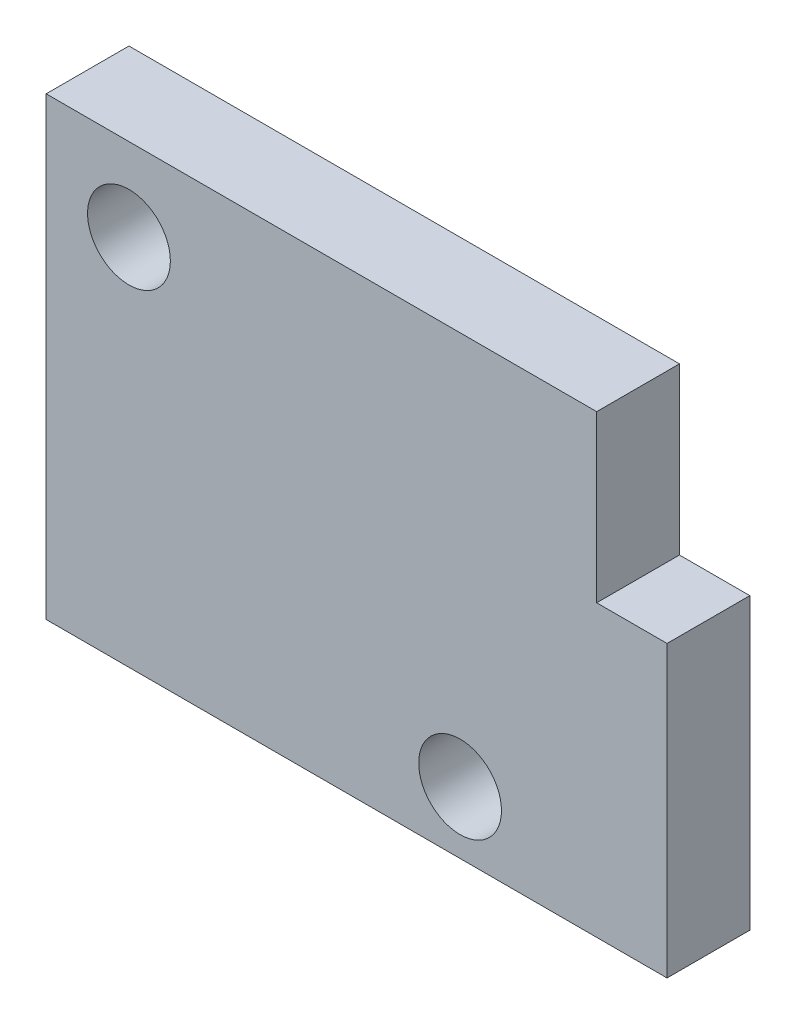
ISO-10303-21;
HEADER;
FILE_DESCRIPTION(('STEP AP214'),'2;1');
FILE_NAME('part.step','',(''),(''),'','','');
FILE_SCHEMA(('AUTOMOTIVE_DESIGN { 1 0 10303 214 1 1 1 1 }'));
ENDSEC;
DATA;
#1=APPLICATION_CONTEXT('core data for automotive mechanical design processes');
#2=APPLICATION_PROTOCOL_DEFINITION('international standard','automotive_design',2000,#1);
#3=PRODUCT_CONTEXT('',#1,'mechanical');
#4=PRODUCT('Part','Part','',(#3));
#5=PRODUCT_RELATED_PRODUCT_CATEGORY('part','',(#4));
#6=PRODUCT_DEFINITION_FORMATION('','',#4);
#7=PRODUCT_DEFINITION_CONTEXT('part definition',#1,'design');
#8=PRODUCT_DEFINITION('design','',#6,#7);
#9=PRODUCT_DEFINITION_SHAPE('','',#8);
#10=(LENGTH_UNIT() NAMED_UNIT(*) SI_UNIT(.MILLI.,.METRE.));
#11=(NAMED_UNIT(*) PLANE_ANGLE_UNIT() SI_UNIT($,.RADIAN.));
#12=(NAMED_UNIT(*) SI_UNIT($,.STERADIAN.) SOLID_ANGLE_UNIT());
#13=UNCERTAINTY_MEASURE_WITH_UNIT(LENGTH_MEASURE(1.E-05),#10,'distance_accuracy_value','');
#14=(GEOMETRIC_REPRESENTATION_CONTEXT(3) GLOBAL_UNCERTAINTY_ASSIGNED_CONTEXT((#13)) GLOBAL_UNIT_ASSIGNED_CONTEXT((#10,
#11,#12)) REPRESENTATION_CONTEXT('',''));
#15=CARTESIAN_POINT('',(0.,0.,0.));
#16=DIRECTION('',(0.,0.,1.));
#17=DIRECTION('',(1.,0.,0.));
#18=AXIS2_PLACEMENT_3D('',#15,#16,#17);
#19=CARTESIAN_POINT('',(0.,0.,1.));
#20=DIRECTION('',(0.,0.,-1.));
#21=DIRECTION('',(-1.,0.,0.));
#22=AXIS2_PLACEMENT_3D('',#19,#20,#21);
#23=PLANE('',#22);
#24=CARTESIAN_POINT('',(-2.49832946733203,1.56544160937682,1.));
#25=DIRECTION('',(0.,0.,1.));
#26=DIRECTION('',(1.,0.,0.));
#27=AXIS2_PLACEMENT_3D('',#24,#25,#26);
#28=CIRCLE('',#27,0.5);
#29=CARTESIAN_POINT('',(-1.99832946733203,1.56544160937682,1.));
#30=VERTEX_POINT('',#29);
#31=EDGE_CURVE('E126',#30,#30,#28,.T.);
#32=ORIENTED_EDGE('',*,*,#31,.F.);
#33=EDGE_LOOP('',(#32));
#34=FACE_BOUND('',#33,.T.);
#35=DIRECTION('',(0.,-1.,0.));
#36=VECTOR('',#35,1.);
#37=CARTESIAN_POINT('',(-3.49832946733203,2.56544160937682,1.));
#38=LINE('',#37,#36);
#39=CARTESIAN_POINT('',(-3.49832946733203,2.56544160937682,1.));
#40=VERTEX_POINT('',#39);
#41=CARTESIAN_POINT('',(-3.49832946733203,-2.93455839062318,1.));
#42=VERTEX_POINT('',#41);
#43=EDGE_CURVE('E133',#40,#42,#38,.T.);
#44=ORIENTED_EDGE('',*,*,#43,.T.);
#45=DIRECTION('',(1.,0.,0.));
#46=VECTOR('',#45,1.);
#47=CARTESIAN_POINT('',(4.00167053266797,-2.93455839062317,1.));
#48=LINE('',#47,#46);
#49=CARTESIAN_POINT('',(4.00167053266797,-2.93455839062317,1.));
#50=VERTEX_POINT('',#49);
#51=EDGE_CURVE('E91',#42,#50,#48,.T.);
#52=ORIENTED_EDGE('',*,*,#51,.T.);
#53=DIRECTION('',(0.,1.,0.));
#54=VECTOR('',#53,1.);
#55=CARTESIAN_POINT('',(4.00167053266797,0.565441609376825,1.));
#56=LINE('',#55,#54);
#57=CARTESIAN_POINT('',(4.00167053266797,0.565441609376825,1.));
#58=VERTEX_POINT('',#57);
#59=EDGE_CURVE('E104',#50,#58,#56,.T.);
#60=ORIENTED_EDGE('',*,*,#59,.T.);
#61=DIRECTION('',(-1.,0.,0.));
#62=VECTOR('',#61,1.);
#63=CARTESIAN_POINT('',(3.15167053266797,0.565441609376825,1.));
#64=LINE('',#63,#62);
#65=CARTESIAN_POINT('',(3.15167053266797,0.565441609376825,1.));
#66=VERTEX_POINT('',#65);
#67=EDGE_CURVE('E98',#58,#66,#64,.T.);
#68=ORIENTED_EDGE('',*,*,#67,.T.);
#69=DIRECTION('',(0.,1.,0.));
#70=VECTOR('',#69,1.);
#71=CARTESIAN_POINT('',(3.15167053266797,2.56544160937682,1.));
#72=LINE('',#71,#70);
#73=CARTESIAN_POINT('',(3.15167053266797,2.56544160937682,1.));
#74=VERTEX_POINT('',#73);
#75=EDGE_CURVE('E102',#66,#74,#72,.T.);
#76=ORIENTED_EDGE('',*,*,#75,.T.);
#77=DIRECTION('',(-1.,0.,0.));
#78=VECTOR('',#77,1.);
#79=CARTESIAN_POINT('',(3.15167053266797,2.56544160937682,1.));
#80=LINE('',#79,#78);
#81=EDGE_CURVE('E54',#74,#40,#80,.T.);
#82=ORIENTED_EDGE('',*,*,#81,.T.);
#83=EDGE_LOOP('',(#44,#52,#60,#68,#76,#82));
#84=FACE_BOUND('',#83,.T.);
#85=CARTESIAN_POINT('',(1.50167053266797,-2.18455839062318,1.));
#86=DIRECTION('',(0.,0.,1.));
#87=DIRECTION('',(1.,0.,0.));
#88=AXIS2_PLACEMENT_3D('',#85,#86,#87);
#89=CIRCLE('',#88,0.5);
#90=CARTESIAN_POINT('',(2.00167053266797,-2.18455839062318,1.));
#91=VERTEX_POINT('',#90);
#92=EDGE_CURVE('E176',#91,#91,#89,.T.);
#93=ORIENTED_EDGE('',*,*,#92,.F.);
#94=EDGE_LOOP('',(#93));
#95=FACE_BOUND('',#94,.T.);
#96=ADVANCED_FACE('F37',(#34,#84,#95),#23,.F.);
#97=CARTESIAN_POINT('',(0.,0.,0.));
#98=DIRECTION('',(0.,0.,-1.));
#99=DIRECTION('',(-1.,0.,0.));
#100=AXIS2_PLACEMENT_3D('',#97,#98,#99);
#101=PLANE('',#100);
#102=CARTESIAN_POINT('',(-2.49832946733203,1.56544160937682,0.));
#103=DIRECTION('',(0.,0.,1.));
#104=DIRECTION('',(1.,0.,0.));
#105=AXIS2_PLACEMENT_3D('',#102,#103,#104);
#106=CIRCLE('',#105,0.5);
#107=CARTESIAN_POINT('',(-1.99832946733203,1.56544160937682,0.));
#108=VERTEX_POINT('',#107);
#109=EDGE_CURVE('E181',#108,#108,#106,.T.);
#110=ORIENTED_EDGE('',*,*,#109,.T.);
#111=EDGE_LOOP('',(#110));
#112=FACE_BOUND('',#111,.T.);
#113=DIRECTION('',(0.,-1.,0.));
#114=VECTOR('',#113,1.);
#115=CARTESIAN_POINT('',(-3.49832946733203,2.56544160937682,0.));
#116=LINE('',#115,#114);
#117=CARTESIAN_POINT('',(-3.49832946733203,2.56544160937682,0.));
#118=VERTEX_POINT('',#117);
#119=CARTESIAN_POINT('',(-3.49832946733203,-2.93455839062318,0.));
#120=VERTEX_POINT('',#119);
#121=EDGE_CURVE('E122',#118,#120,#116,.T.);
#122=ORIENTED_EDGE('',*,*,#121,.F.);
#123=DIRECTION('',(-1.,0.,0.));
#124=VECTOR('',#123,1.);
#125=CARTESIAN_POINT('',(3.15167053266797,2.56544160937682,0.));
#126=LINE('',#125,#124);
#127=CARTESIAN_POINT('',(3.15167053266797,2.56544160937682,0.));
#128=VERTEX_POINT('',#127);
#129=EDGE_CURVE('E83',#128,#118,#126,.T.);
#130=ORIENTED_EDGE('',*,*,#129,.F.);
#131=DIRECTION('',(0.,1.,0.));
#132=VECTOR('',#131,1.);
#133=CARTESIAN_POINT('',(3.15167053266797,2.56544160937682,0.));
#134=LINE('',#133,#132);
#135=CARTESIAN_POINT('',(3.15167053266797,0.565441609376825,0.));
#136=VERTEX_POINT('',#135);
#137=EDGE_CURVE('E77',#136,#128,#134,.T.);
#138=ORIENTED_EDGE('',*,*,#137,.F.);
#139=DIRECTION('',(-1.,0.,0.));
#140=VECTOR('',#139,1.);
#141=CARTESIAN_POINT('',(3.15167053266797,0.565441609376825,0.));
#142=LINE('',#141,#140);
#143=CARTESIAN_POINT('',(4.00167053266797,0.565441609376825,0.));
#144=VERTEX_POINT('',#143);
#145=EDGE_CURVE('E112',#144,#136,#142,.T.);
#146=ORIENTED_EDGE('',*,*,#145,.F.);
#147=DIRECTION('',(0.,1.,0.));
#148=VECTOR('',#147,1.);
#149=CARTESIAN_POINT('',(4.00167053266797,0.565441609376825,0.));
#150=LINE('',#149,#148);
#151=CARTESIAN_POINT('',(4.00167053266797,-2.93455839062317,0.));
#152=VERTEX_POINT('',#151);
#153=EDGE_CURVE('E128',#152,#144,#150,.T.);
#154=ORIENTED_EDGE('',*,*,#153,.F.);
#155=DIRECTION('',(1.,0.,0.));
#156=VECTOR('',#155,1.);
#157=CARTESIAN_POINT('',(4.00167053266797,-2.93455839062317,0.));
#158=LINE('',#157,#156);
#159=EDGE_CURVE('E125',#120,#152,#158,.T.);
#160=ORIENTED_EDGE('',*,*,#159,.F.);
#161=EDGE_LOOP('',(#122,#130,#138,#146,#154,#160));
#162=FACE_BOUND('',#161,.T.);
#163=CARTESIAN_POINT('',(1.50167053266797,-2.18455839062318,0.));
#164=DIRECTION('',(0.,0.,1.));
#165=DIRECTION('',(1.,0.,0.));
#166=AXIS2_PLACEMENT_3D('',#163,#164,#165);
#167=CIRCLE('',#166,0.5);
#168=CARTESIAN_POINT('',(2.00167053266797,-2.18455839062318,0.));
#169=VERTEX_POINT('',#168);
#170=EDGE_CURVE('E179',#169,#169,#167,.T.);
#171=ORIENTED_EDGE('',*,*,#170,.T.);
#172=EDGE_LOOP('',(#171));
#173=FACE_BOUND('',#172,.T.);
#174=ADVANCED_FACE('F142',(#112,#162,#173),#101,.T.);
#175=CARTESIAN_POINT('',(-3.49832946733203,2.56544160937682,1.));
#176=DIRECTION('',(1.,0.,0.));
#177=DIRECTION('',(0.,1.,0.));
#178=AXIS2_PLACEMENT_3D('',#175,#176,#177);
#179=PLANE('',#178);
#180=ORIENTED_EDGE('',*,*,#121,.T.);
#181=DIRECTION('',(0.,0.,-1.));
#182=VECTOR('',#181,1.);
#183=CARTESIAN_POINT('',(-3.49832946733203,-2.93455839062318,1.));
#184=LINE('',#183,#182);
#185=EDGE_CURVE('E11',#42,#120,#184,.T.);
#186=ORIENTED_EDGE('',*,*,#185,.F.);
#187=ORIENTED_EDGE('',*,*,#43,.F.);
#188=DIRECTION('',(0.,0.,-1.));
#189=VECTOR('',#188,1.);
#190=CARTESIAN_POINT('',(-3.49832946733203,2.56544160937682,1.));
#191=LINE('',#190,#189);
#192=EDGE_CURVE('E118',#40,#118,#191,.T.);
#193=ORIENTED_EDGE('',*,*,#192,.T.);
#194=EDGE_LOOP('',(#180,#186,#187,#193));
#195=FACE_BOUND('',#194,.T.);
#196=ADVANCED_FACE('F39',(#195),#179,.F.);
#197=CARTESIAN_POINT('',(4.00167053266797,-2.93455839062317,1.));
#198=DIRECTION('',(0.,1.,0.));
#199=DIRECTION('',(-1.,0.,0.));
#200=AXIS2_PLACEMENT_3D('',#197,#198,#199);
#201=PLANE('',#200);
#202=ORIENTED_EDGE('',*,*,#159,.T.);
#203=DIRECTION('',(0.,0.,-1.));
#204=VECTOR('',#203,1.);
#205=CARTESIAN_POINT('',(4.00167053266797,-2.93455839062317,1.));
#206=LINE('',#205,#204);
#207=EDGE_CURVE('E46',#50,#152,#206,.T.);
#208=ORIENTED_EDGE('',*,*,#207,.F.);
#209=ORIENTED_EDGE('',*,*,#51,.F.);
#210=ORIENTED_EDGE('',*,*,#185,.T.);
#211=EDGE_LOOP('',(#202,#208,#209,#210));
#212=FACE_BOUND('',#211,.T.);
#213=ADVANCED_FACE('F222',(#212),#201,.F.);
#214=CARTESIAN_POINT('',(4.00167053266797,0.565441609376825,1.));
#215=DIRECTION('',(-1.,0.,0.));
#216=DIRECTION('',(0.,0.,1.));
#217=AXIS2_PLACEMENT_3D('',#214,#215,#216);
#218=PLANE('',#217);
#219=ORIENTED_EDGE('',*,*,#153,.T.);
#220=DIRECTION('',(0.,0.,-1.));
#221=VECTOR('',#220,1.);
#222=CARTESIAN_POINT('',(4.00167053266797,0.565441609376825,1.));
#223=LINE('',#222,#221);
#224=EDGE_CURVE('E113',#58,#144,#223,.T.);
#225=ORIENTED_EDGE('',*,*,#224,.F.);
#226=ORIENTED_EDGE('',*,*,#59,.F.);
#227=ORIENTED_EDGE('',*,*,#207,.T.);
#228=EDGE_LOOP('',(#219,#225,#226,#227));
#229=FACE_BOUND('',#228,.T.);
#230=ADVANCED_FACE('F139',(#229),#218,.F.);
#231=CARTESIAN_POINT('',(3.15167053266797,0.565441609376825,1.));
#232=DIRECTION('',(0.,-1.,0.));
#233=DIRECTION('',(0.,0.,-1.));
#234=AXIS2_PLACEMENT_3D('',#231,#232,#233);
#235=PLANE('',#234);
#236=ORIENTED_EDGE('',*,*,#145,.T.);
#237=DIRECTION('',(0.,0.,-1.));
#238=VECTOR('',#237,1.);
#239=CARTESIAN_POINT('',(3.15167053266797,0.565441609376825,1.));
#240=LINE('',#239,#238);
#241=EDGE_CURVE('E109',#66,#136,#240,.T.);
#242=ORIENTED_EDGE('',*,*,#241,.F.);
#243=ORIENTED_EDGE('',*,*,#67,.F.);
#244=ORIENTED_EDGE('',*,*,#224,.T.);
#245=EDGE_LOOP('',(#236,#242,#243,#244));
#246=FACE_BOUND('',#245,.T.);
#247=ADVANCED_FACE('F110',(#246),#235,.F.);
#248=CARTESIAN_POINT('',(3.15167053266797,2.56544160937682,1.));
#249=DIRECTION('',(-1.,0.,0.));
#250=DIRECTION('',(0.,-1.,0.));
#251=AXIS2_PLACEMENT_3D('',#248,#249,#250);
#252=PLANE('',#251);
#253=ORIENTED_EDGE('',*,*,#137,.T.);
#254=DIRECTION('',(0.,0.,-1.));
#255=VECTOR('',#254,1.);
#256=CARTESIAN_POINT('',(3.15167053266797,2.56544160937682,1.));
#257=LINE('',#256,#255);
#258=EDGE_CURVE('E114',#74,#128,#257,.T.);
#259=ORIENTED_EDGE('',*,*,#258,.F.);
#260=ORIENTED_EDGE('',*,*,#75,.F.);
#261=ORIENTED_EDGE('',*,*,#241,.T.);
#262=EDGE_LOOP('',(#253,#259,#260,#261));
#263=FACE_BOUND('',#262,.T.);
#264=ADVANCED_FACE('F116',(#263),#252,.F.);
#265=CARTESIAN_POINT('',(3.15167053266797,2.56544160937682,1.));
#266=DIRECTION('',(0.,-1.,0.));
#267=DIRECTION('',(1.,0.,0.));
#268=AXIS2_PLACEMENT_3D('',#265,#266,#267);
#269=PLANE('',#268);
#270=ORIENTED_EDGE('',*,*,#129,.T.);
#271=ORIENTED_EDGE('',*,*,#192,.F.);
#272=ORIENTED_EDGE('',*,*,#81,.F.);
#273=ORIENTED_EDGE('',*,*,#258,.T.);
#274=EDGE_LOOP('',(#270,#271,#272,#273));
#275=FACE_BOUND('',#274,.T.);
#276=ADVANCED_FACE('F147',(#275),#269,.F.);
#277=CARTESIAN_POINT('',(-2.49832946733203,1.56544160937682,1.));
#278=DIRECTION('',(0.,0.,-1.));
#279=DIRECTION('',(-1.,0.,0.));
#280=AXIS2_PLACEMENT_3D('',#277,#278,#279);
#281=CYLINDRICAL_SURFACE('',#280,0.5);
#282=ORIENTED_EDGE('',*,*,#31,.T.);
#283=EDGE_LOOP('',(#282));
#284=FACE_BOUND('',#283,.T.);
#285=ORIENTED_EDGE('',*,*,#109,.F.);
#286=EDGE_LOOP('',(#285));
#287=FACE_BOUND('',#286,.T.);
#288=ADVANCED_FACE('F149',(#284,#287),#281,.F.);
#289=CARTESIAN_POINT('',(1.50167053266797,-2.18455839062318,1.));
#290=DIRECTION('',(0.,0.,-1.));
#291=DIRECTION('',(-1.,0.,0.));
#292=AXIS2_PLACEMENT_3D('',#289,#290,#291);
#293=CYLINDRICAL_SURFACE('',#292,0.5);
#294=ORIENTED_EDGE('',*,*,#92,.T.);
#295=EDGE_LOOP('',(#294));
#296=FACE_BOUND('',#295,.T.);
#297=ORIENTED_EDGE('',*,*,#170,.F.);
#298=EDGE_LOOP('',(#297));
#299=FACE_BOUND('',#298,.T.);
#300=ADVANCED_FACE('F155',(#296,#299),#293,.F.);
#301=CLOSED_SHELL('',(#96,#174,#196,#213,#230,#247,#264,#276,#288,#300));
#302=MANIFOLD_SOLID_BREP('B2',#301);
#303=ADVANCED_BREP_SHAPE_REPRESENTATION('',(#18,#302),#14);
#304=SHAPE_DEFINITION_REPRESENTATION(#9,#303);
ENDSEC;
END-ISO-10303-21;
